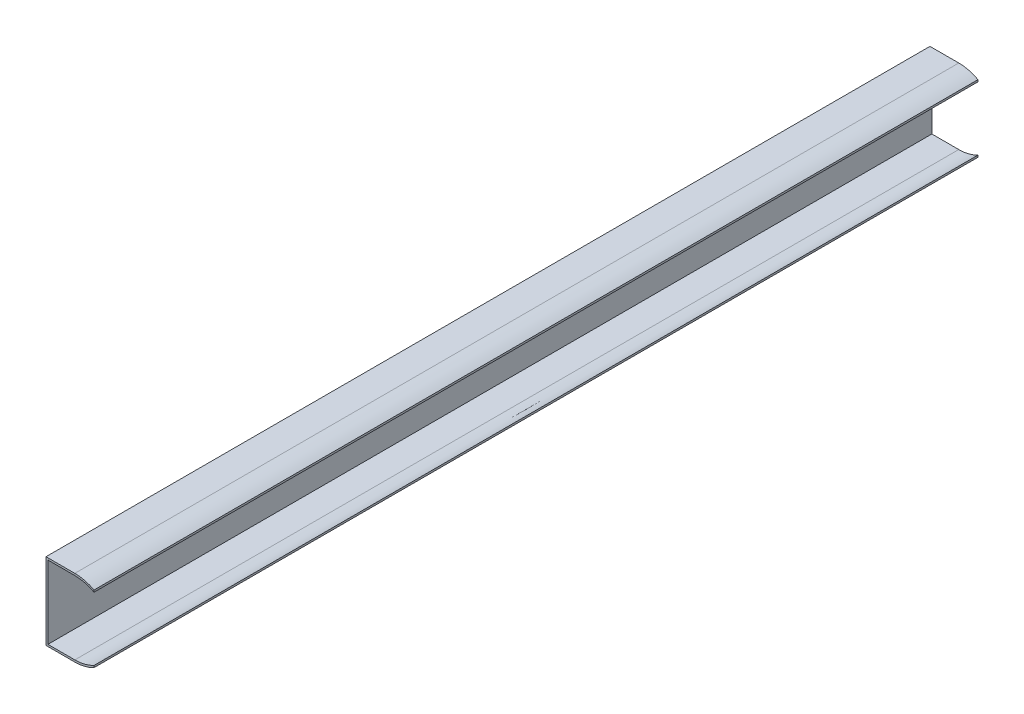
ISO-10303-21;
HEADER;
FILE_DESCRIPTION(('STEP AP214'),'2;1');
FILE_NAME('part.step','',(''),(''),'','','');
FILE_SCHEMA(('AUTOMOTIVE_DESIGN { 1 0 10303 214 1 1 1 1 }'));
ENDSEC;
DATA;
#1=APPLICATION_CONTEXT('core data for automotive mechanical design processes');
#2=APPLICATION_PROTOCOL_DEFINITION('international standard','automotive_design',2000,#1);
#3=PRODUCT_CONTEXT('',#1,'mechanical');
#4=PRODUCT('Part','Part','',(#3));
#5=PRODUCT_RELATED_PRODUCT_CATEGORY('part','',(#4));
#6=PRODUCT_DEFINITION_FORMATION('','',#4);
#7=PRODUCT_DEFINITION_CONTEXT('part definition',#1,'design');
#8=PRODUCT_DEFINITION('design','',#6,#7);
#9=PRODUCT_DEFINITION_SHAPE('','',#8);
#10=(LENGTH_UNIT() NAMED_UNIT(*) SI_UNIT(.MILLI.,.METRE.));
#11=(NAMED_UNIT(*) PLANE_ANGLE_UNIT() SI_UNIT($,.RADIAN.));
#12=(NAMED_UNIT(*) SI_UNIT($,.STERADIAN.) SOLID_ANGLE_UNIT());
#13=UNCERTAINTY_MEASURE_WITH_UNIT(LENGTH_MEASURE(1.E-05),#10,'distance_accuracy_value','');
#14=(GEOMETRIC_REPRESENTATION_CONTEXT(3) GLOBAL_UNCERTAINTY_ASSIGNED_CONTEXT((#13)) GLOBAL_UNIT_ASSIGNED_CONTEXT((#10,
#11,#12)) REPRESENTATION_CONTEXT('',''));
#15=CARTESIAN_POINT('',(0.,0.,0.));
#16=DIRECTION('',(0.,0.,1.));
#17=DIRECTION('',(1.,0.,0.));
#18=AXIS2_PLACEMENT_3D('',#15,#16,#17);
#19=CARTESIAN_POINT('',(0.,0.,920.));
#20=DIRECTION('',(0.,1.,0.));
#21=DIRECTION('',(0.,0.,1.));
#22=AXIS2_PLACEMENT_3D('',#19,#20,#21);
#23=PLANE('',#22);
#24=DIRECTION('',(1.,0.,0.));
#25=VECTOR('',#24,1.);
#26=CARTESIAN_POINT('',(0.,0.,0.));
#27=LINE('',#26,#25);
#28=CARTESIAN_POINT('',(0.,0.,0.));
#29=VERTEX_POINT('',#28);
#30=CARTESIAN_POINT('',(30.,0.,0.));
#31=VERTEX_POINT('',#30);
#32=EDGE_CURVE('E155',#29,#31,#27,.T.);
#33=ORIENTED_EDGE('',*,*,#32,.T.);
#34=DIRECTION('',(0.,0.,-1.));
#35=VECTOR('',#34,1.);
#36=CARTESIAN_POINT('',(30.,0.,920.));
#37=LINE('',#36,#35);
#38=CARTESIAN_POINT('',(30.,0.,920.));
#39=VERTEX_POINT('',#38);
#40=EDGE_CURVE('E11',#39,#31,#37,.T.);
#41=ORIENTED_EDGE('',*,*,#40,.F.);
#42=DIRECTION('',(1.,0.,0.));
#43=VECTOR('',#42,1.);
#44=CARTESIAN_POINT('',(0.,0.,920.));
#45=LINE('',#44,#43);
#46=CARTESIAN_POINT('',(0.,0.,920.));
#47=VERTEX_POINT('',#46);
#48=EDGE_CURVE('E197',#47,#39,#45,.T.);
#49=ORIENTED_EDGE('',*,*,#48,.F.);
#50=DIRECTION('',(0.,0.,-1.));
#51=VECTOR('',#50,1.);
#52=CARTESIAN_POINT('',(0.,0.,920.));
#53=LINE('',#52,#51);
#54=EDGE_CURVE('E148',#47,#29,#53,.T.);
#55=ORIENTED_EDGE('',*,*,#54,.T.);
#56=EDGE_LOOP('',(#33,#41,#49,#55));
#57=FACE_BOUND('',#56,.T.);
#58=ADVANCED_FACE('F32',(#57),#23,.F.);
#59=CARTESIAN_POINT('',(30.,0.,920.));
#60=CARTESIAN_POINT('',(40.6032812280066,0.0484567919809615,920.));
#61=CARTESIAN_POINT('',(50.,5.,920.));
#62=B_SPLINE_CURVE_WITH_KNOTS('',2,(#59,#60,#61),.UNSPECIFIED.,.F.,.F.,(3,3),(0.,1.),.UNSPECIFIED.);
#63=DIRECTION('',(0.,0.,-1.));
#64=VECTOR('',#63,1.);
#65=SURFACE_OF_LINEAR_EXTRUSION('',#62,#64);
#66=CARTESIAN_POINT('',(30.,0.,0.));
#67=CARTESIAN_POINT('',(40.6032812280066,0.0484567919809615,0.));
#68=CARTESIAN_POINT('',(50.,5.,0.));
#69=B_SPLINE_CURVE_WITH_KNOTS('',2,(#66,#67,#68),.UNSPECIFIED.,.F.,.F.,(3,3),(0.,1.),.UNSPECIFIED.);
#70=CARTESIAN_POINT('',(50.,5.,0.));
#71=VERTEX_POINT('',#70);
#72=EDGE_CURVE('E158',#31,#71,#69,.T.);
#73=ORIENTED_EDGE('',*,*,#72,.T.);
#74=DIRECTION('',(0.,0.,-1.));
#75=VECTOR('',#74,1.);
#76=CARTESIAN_POINT('',(50.,5.,920.));
#77=LINE('',#76,#75);
#78=CARTESIAN_POINT('',(50.,5.,920.));
#79=VERTEX_POINT('',#78);
#80=EDGE_CURVE('E40',#79,#71,#77,.T.);
#81=ORIENTED_EDGE('',*,*,#80,.F.);
#82=EDGE_CURVE('E103',#39,#79,#62,.T.);
#83=ORIENTED_EDGE('',*,*,#82,.F.);
#84=ORIENTED_EDGE('',*,*,#40,.T.);
#85=EDGE_LOOP('',(#73,#81,#83,#84));
#86=FACE_BOUND('',#85,.T.);
#87=ADVANCED_FACE('F281',(#86),#65,.F.);
#88=CARTESIAN_POINT('',(50.,5.,920.));
#89=DIRECTION('',(-1.,0.,0.));
#90=DIRECTION('',(0.,0.,1.));
#91=AXIS2_PLACEMENT_3D('',#88,#89,#90);
#92=PLANE('',#91);
#93=DIRECTION('',(0.,1.,0.));
#94=VECTOR('',#93,1.);
#95=CARTESIAN_POINT('',(50.,5.,0.));
#96=LINE('',#95,#94);
#97=CARTESIAN_POINT('',(50.,7.00000000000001,0.));
#98=VERTEX_POINT('',#97);
#99=EDGE_CURVE('E162',#71,#98,#96,.T.);
#100=ORIENTED_EDGE('',*,*,#99,.T.);
#101=DIRECTION('',(0.,0.,-1.));
#102=VECTOR('',#101,1.);
#103=CARTESIAN_POINT('',(50.,7.00000000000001,920.));
#104=LINE('',#103,#102);
#105=CARTESIAN_POINT('',(50.,7.00000000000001,920.));
#106=VERTEX_POINT('',#105);
#107=EDGE_CURVE('E216',#106,#98,#104,.T.);
#108=ORIENTED_EDGE('',*,*,#107,.F.);
#109=DIRECTION('',(0.,1.,0.));
#110=VECTOR('',#109,1.);
#111=CARTESIAN_POINT('',(50.,5.,920.));
#112=LINE('',#111,#110);
#113=EDGE_CURVE('E224',#79,#106,#112,.T.);
#114=ORIENTED_EDGE('',*,*,#113,.F.);
#115=ORIENTED_EDGE('',*,*,#80,.T.);
#116=EDGE_LOOP('',(#100,#108,#114,#115));
#117=FACE_BOUND('',#116,.T.);
#118=ADVANCED_FACE('F222',(#117),#92,.F.);
#119=CARTESIAN_POINT('',(50.,7.00000000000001,920.));
#120=CARTESIAN_POINT('',(40.6032812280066,2.04845679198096,920.));
#121=CARTESIAN_POINT('',(30.,2.,920.));
#122=B_SPLINE_CURVE_WITH_KNOTS('',2,(#119,#120,#121),.UNSPECIFIED.,.F.,.F.,(3,3),(0.,1.),.UNSPECIFIED.);
#123=DIRECTION('',(0.,0.,-1.));
#124=VECTOR('',#123,1.);
#125=SURFACE_OF_LINEAR_EXTRUSION('',#122,#124);
#126=CARTESIAN_POINT('',(50.,7.00000000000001,0.));
#127=CARTESIAN_POINT('',(40.6032812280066,2.04845679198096,0.));
#128=CARTESIAN_POINT('',(30.,2.,0.));
#129=B_SPLINE_CURVE_WITH_KNOTS('',2,(#126,#127,#128),.UNSPECIFIED.,.F.,.F.,(3,3),(0.,1.),.UNSPECIFIED.);
#130=CARTESIAN_POINT('',(30.,2.,0.));
#131=VERTEX_POINT('',#130);
#132=EDGE_CURVE('E167',#98,#131,#129,.T.);
#133=ORIENTED_EDGE('',*,*,#132,.T.);
#134=DIRECTION('',(0.,0.,-1.));
#135=VECTOR('',#134,1.);
#136=CARTESIAN_POINT('',(30.,2.,920.));
#137=LINE('',#136,#135);
#138=CARTESIAN_POINT('',(30.,2.,920.));
#139=VERTEX_POINT('',#138);
#140=EDGE_CURVE('E213',#139,#131,#137,.T.);
#141=ORIENTED_EDGE('',*,*,#140,.F.);
#142=EDGE_CURVE('E242',#106,#139,#122,.T.);
#143=ORIENTED_EDGE('',*,*,#142,.F.);
#144=ORIENTED_EDGE('',*,*,#107,.T.);
#145=EDGE_LOOP('',(#133,#141,#143,#144));
#146=FACE_BOUND('',#145,.T.);
#147=ADVANCED_FACE('F233',(#146),#125,.F.);
#148=CARTESIAN_POINT('',(2.,2.,920.));
#149=DIRECTION('',(0.,-1.,0.));
#150=DIRECTION('',(0.,0.,-1.));
#151=AXIS2_PLACEMENT_3D('',#148,#149,#150);
#152=PLANE('',#151);
#153=DIRECTION('',(-1.,0.,0.));
#154=VECTOR('',#153,1.);
#155=CARTESIAN_POINT('',(2.,2.,0.));
#156=LINE('',#155,#154);
#157=CARTESIAN_POINT('',(2.,2.,0.));
#158=VERTEX_POINT('',#157);
#159=EDGE_CURVE('E171',#131,#158,#156,.T.);
#160=ORIENTED_EDGE('',*,*,#159,.T.);
#161=DIRECTION('',(0.,0.,-1.));
#162=VECTOR('',#161,1.);
#163=CARTESIAN_POINT('',(2.,2.,920.));
#164=LINE('',#163,#162);
#165=CARTESIAN_POINT('',(2.,2.,920.));
#166=VERTEX_POINT('',#165);
#167=EDGE_CURVE('E210',#166,#158,#164,.T.);
#168=ORIENTED_EDGE('',*,*,#167,.F.);
#169=DIRECTION('',(-1.,0.,0.));
#170=VECTOR('',#169,1.);
#171=CARTESIAN_POINT('',(2.,2.,920.));
#172=LINE('',#171,#170);
#173=EDGE_CURVE('E239',#139,#166,#172,.T.);
#174=ORIENTED_EDGE('',*,*,#173,.F.);
#175=ORIENTED_EDGE('',*,*,#140,.T.);
#176=EDGE_LOOP('',(#160,#168,#174,#175));
#177=FACE_BOUND('',#176,.T.);
#178=ADVANCED_FACE('F237',(#177),#152,.F.);
#179=CARTESIAN_POINT('',(2.,78.,920.));
#180=DIRECTION('',(-1.,0.,0.));
#181=DIRECTION('',(0.,0.,1.));
#182=AXIS2_PLACEMENT_3D('',#179,#180,#181);
#183=PLANE('',#182);
#184=DIRECTION('',(0.,1.,0.));
#185=VECTOR('',#184,1.);
#186=CARTESIAN_POINT('',(2.,78.,0.));
#187=LINE('',#186,#185);
#188=CARTESIAN_POINT('',(2.,78.,0.));
#189=VERTEX_POINT('',#188);
#190=EDGE_CURVE('E176',#158,#189,#187,.T.);
#191=ORIENTED_EDGE('',*,*,#190,.T.);
#192=DIRECTION('',(0.,0.,-1.));
#193=VECTOR('',#192,1.);
#194=CARTESIAN_POINT('',(2.,78.,920.));
#195=LINE('',#194,#193);
#196=CARTESIAN_POINT('',(2.,78.,920.));
#197=VERTEX_POINT('',#196);
#198=EDGE_CURVE('E207',#197,#189,#195,.T.);
#199=ORIENTED_EDGE('',*,*,#198,.F.);
#200=DIRECTION('',(0.,1.,0.));
#201=VECTOR('',#200,1.);
#202=CARTESIAN_POINT('',(2.,78.,920.));
#203=LINE('',#202,#201);
#204=EDGE_CURVE('E241',#166,#197,#203,.T.);
#205=ORIENTED_EDGE('',*,*,#204,.F.);
#206=ORIENTED_EDGE('',*,*,#167,.T.);
#207=EDGE_LOOP('',(#191,#199,#205,#206));
#208=FACE_BOUND('',#207,.T.);
#209=ADVANCED_FACE('F271',(#208),#183,.F.);
#210=CARTESIAN_POINT('',(2.,78.,920.));
#211=DIRECTION('',(0.,1.,0.));
#212=DIRECTION('',(0.,0.,1.));
#213=AXIS2_PLACEMENT_3D('',#210,#211,#212);
#214=PLANE('',#213);
#215=DIRECTION('',(1.,0.,0.));
#216=VECTOR('',#215,1.);
#217=CARTESIAN_POINT('',(2.,78.,0.));
#218=LINE('',#217,#216);
#219=CARTESIAN_POINT('',(30.,78.,0.));
#220=VERTEX_POINT('',#219);
#221=EDGE_CURVE('E178',#189,#220,#218,.T.);
#222=ORIENTED_EDGE('',*,*,#221,.T.);
#223=DIRECTION('',(0.,0.,-1.));
#224=VECTOR('',#223,1.);
#225=CARTESIAN_POINT('',(30.,78.,920.));
#226=LINE('',#225,#224);
#227=CARTESIAN_POINT('',(30.,78.,920.));
#228=VERTEX_POINT('',#227);
#229=EDGE_CURVE('E204',#228,#220,#226,.T.);
#230=ORIENTED_EDGE('',*,*,#229,.F.);
#231=DIRECTION('',(1.,0.,0.));
#232=VECTOR('',#231,1.);
#233=CARTESIAN_POINT('',(2.,78.,920.));
#234=LINE('',#233,#232);
#235=EDGE_CURVE('E244',#197,#228,#234,.T.);
#236=ORIENTED_EDGE('',*,*,#235,.F.);
#237=ORIENTED_EDGE('',*,*,#198,.T.);
#238=EDGE_LOOP('',(#222,#230,#236,#237));
#239=FACE_BOUND('',#238,.T.);
#240=ADVANCED_FACE('F266',(#239),#214,.F.);
#241=CARTESIAN_POINT('',(30.,78.,920.));
#242=CARTESIAN_POINT('',(40.6032812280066,77.951543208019,920.));
#243=CARTESIAN_POINT('',(50.,73.,920.));
#244=B_SPLINE_CURVE_WITH_KNOTS('',2,(#241,#242,#243),.UNSPECIFIED.,.F.,.F.,(3,3),(0.,1.),.UNSPECIFIED.);
#245=DIRECTION('',(0.,0.,-1.));
#246=VECTOR('',#245,1.);
#247=SURFACE_OF_LINEAR_EXTRUSION('',#244,#246);
#248=CARTESIAN_POINT('',(30.,78.,0.));
#249=CARTESIAN_POINT('',(40.6032812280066,77.951543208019,0.));
#250=CARTESIAN_POINT('',(50.,73.,0.));
#251=B_SPLINE_CURVE_WITH_KNOTS('',2,(#248,#249,#250),.UNSPECIFIED.,.F.,.F.,(3,3),(0.,1.),.UNSPECIFIED.);
#252=CARTESIAN_POINT('',(50.,73.,0.));
#253=VERTEX_POINT('',#252);
#254=EDGE_CURVE('E180',#220,#253,#251,.T.);
#255=ORIENTED_EDGE('',*,*,#254,.T.);
#256=DIRECTION('',(0.,0.,-1.));
#257=VECTOR('',#256,1.);
#258=CARTESIAN_POINT('',(50.,73.,920.));
#259=LINE('',#258,#257);
#260=CARTESIAN_POINT('',(50.,73.,920.));
#261=VERTEX_POINT('',#260);
#262=EDGE_CURVE('E201',#261,#253,#259,.T.);
#263=ORIENTED_EDGE('',*,*,#262,.F.);
#264=EDGE_CURVE('E253',#228,#261,#244,.T.);
#265=ORIENTED_EDGE('',*,*,#264,.F.);
#266=ORIENTED_EDGE('',*,*,#229,.T.);
#267=EDGE_LOOP('',(#255,#263,#265,#266));
#268=FACE_BOUND('',#267,.T.);
#269=ADVANCED_FACE('F261',(#268),#247,.F.);
#270=CARTESIAN_POINT('',(50.,75.,920.));
#271=DIRECTION('',(-1.,0.,0.));
#272=DIRECTION('',(0.,0.,1.));
#273=AXIS2_PLACEMENT_3D('',#270,#271,#272);
#274=PLANE('',#273);
#275=DIRECTION('',(0.,1.,0.));
#276=VECTOR('',#275,1.);
#277=CARTESIAN_POINT('',(50.,75.,0.));
#278=LINE('',#277,#276);
#279=CARTESIAN_POINT('',(50.,75.,0.));
#280=VERTEX_POINT('',#279);
#281=EDGE_CURVE('E184',#253,#280,#278,.T.);
#282=ORIENTED_EDGE('',*,*,#281,.T.);
#283=DIRECTION('',(0.,0.,-1.));
#284=VECTOR('',#283,1.);
#285=CARTESIAN_POINT('',(50.,75.,920.));
#286=LINE('',#285,#284);
#287=CARTESIAN_POINT('',(50.,75.,920.));
#288=VERTEX_POINT('',#287);
#289=EDGE_CURVE('E143',#288,#280,#286,.T.);
#290=ORIENTED_EDGE('',*,*,#289,.F.);
#291=DIRECTION('',(0.,1.,0.));
#292=VECTOR('',#291,1.);
#293=CARTESIAN_POINT('',(50.,75.,920.));
#294=LINE('',#293,#292);
#295=EDGE_CURVE('E134',#261,#288,#294,.T.);
#296=ORIENTED_EDGE('',*,*,#295,.F.);
#297=ORIENTED_EDGE('',*,*,#262,.T.);
#298=EDGE_LOOP('',(#282,#290,#296,#297));
#299=FACE_BOUND('',#298,.T.);
#300=ADVANCED_FACE('F265',(#299),#274,.F.);
#301=CARTESIAN_POINT('',(50.,75.,920.));
#302=CARTESIAN_POINT('',(40.6032812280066,79.951543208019,920.));
#303=CARTESIAN_POINT('',(30.,80.,920.));
#304=B_SPLINE_CURVE_WITH_KNOTS('',2,(#301,#302,#303),.UNSPECIFIED.,.F.,.F.,(3,3),(0.,1.),.UNSPECIFIED.);
#305=DIRECTION('',(0.,0.,-1.));
#306=VECTOR('',#305,1.);
#307=SURFACE_OF_LINEAR_EXTRUSION('',#304,#306);
#308=CARTESIAN_POINT('',(50.,75.,0.));
#309=CARTESIAN_POINT('',(40.6032812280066,79.951543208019,0.));
#310=CARTESIAN_POINT('',(30.,80.,0.));
#311=B_SPLINE_CURVE_WITH_KNOTS('',2,(#308,#309,#310),.UNSPECIFIED.,.F.,.F.,(3,3),(0.,1.),.UNSPECIFIED.);
#312=CARTESIAN_POINT('',(30.,80.,0.));
#313=VERTEX_POINT('',#312);
#314=EDGE_CURVE('E142',#280,#313,#311,.T.);
#315=ORIENTED_EDGE('',*,*,#314,.T.);
#316=DIRECTION('',(0.,0.,-1.));
#317=VECTOR('',#316,1.);
#318=CARTESIAN_POINT('',(30.,80.,920.));
#319=LINE('',#318,#317);
#320=CARTESIAN_POINT('',(30.,80.,920.));
#321=VERTEX_POINT('',#320);
#322=EDGE_CURVE('E139',#321,#313,#319,.T.);
#323=ORIENTED_EDGE('',*,*,#322,.F.);
#324=EDGE_CURVE('E128',#288,#321,#304,.T.);
#325=ORIENTED_EDGE('',*,*,#324,.F.);
#326=ORIENTED_EDGE('',*,*,#289,.T.);
#327=EDGE_LOOP('',(#315,#323,#325,#326));
#328=FACE_BOUND('',#327,.T.);
#329=ADVANCED_FACE('F140',(#328),#307,.F.);
#330=CARTESIAN_POINT('',(0.,80.,920.));
#331=DIRECTION('',(0.,-1.,0.));
#332=DIRECTION('',(0.,0.,-1.));
#333=AXIS2_PLACEMENT_3D('',#330,#331,#332);
#334=PLANE('',#333);
#335=DIRECTION('',(-1.,0.,0.));
#336=VECTOR('',#335,1.);
#337=CARTESIAN_POINT('',(0.,80.,0.));
#338=LINE('',#337,#336);
#339=CARTESIAN_POINT('',(0.,80.,0.));
#340=VERTEX_POINT('',#339);
#341=EDGE_CURVE('E89',#313,#340,#338,.T.);
#342=ORIENTED_EDGE('',*,*,#341,.T.);
#343=DIRECTION('',(0.,0.,-1.));
#344=VECTOR('',#343,1.);
#345=CARTESIAN_POINT('',(0.,80.,920.));
#346=LINE('',#345,#344);
#347=CARTESIAN_POINT('',(0.,80.,920.));
#348=VERTEX_POINT('',#347);
#349=EDGE_CURVE('E144',#348,#340,#346,.T.);
#350=ORIENTED_EDGE('',*,*,#349,.F.);
#351=DIRECTION('',(-1.,0.,0.));
#352=VECTOR('',#351,1.);
#353=CARTESIAN_POINT('',(0.,80.,920.));
#354=LINE('',#353,#352);
#355=EDGE_CURVE('E132',#321,#348,#354,.T.);
#356=ORIENTED_EDGE('',*,*,#355,.F.);
#357=ORIENTED_EDGE('',*,*,#322,.T.);
#358=EDGE_LOOP('',(#342,#350,#356,#357));
#359=FACE_BOUND('',#358,.T.);
#360=ADVANCED_FACE('F146',(#359),#334,.F.);
#361=CARTESIAN_POINT('',(0.,0.,920.));
#362=DIRECTION('',(1.,0.,0.));
#363=DIRECTION('',(0.,0.,-1.));
#364=AXIS2_PLACEMENT_3D('',#361,#362,#363);
#365=PLANE('',#364);
#366=DIRECTION('',(0.,-1.,0.));
#367=VECTOR('',#366,1.);
#368=CARTESIAN_POINT('',(0.,0.,0.));
#369=LINE('',#368,#367);
#370=EDGE_CURVE('E95',#340,#29,#369,.T.);
#371=ORIENTED_EDGE('',*,*,#370,.T.);
#372=ORIENTED_EDGE('',*,*,#54,.F.);
#373=DIRECTION('',(0.,-1.,0.));
#374=VECTOR('',#373,1.);
#375=CARTESIAN_POINT('',(0.,0.,920.));
#376=LINE('',#375,#374);
#377=EDGE_CURVE('E48',#348,#47,#376,.T.);
#378=ORIENTED_EDGE('',*,*,#377,.F.);
#379=ORIENTED_EDGE('',*,*,#349,.T.);
#380=EDGE_LOOP('',(#371,#372,#378,#379));
#381=FACE_BOUND('',#380,.T.);
#382=ADVANCED_FACE('F357',(#381),#365,.F.);
#383=CARTESIAN_POINT('',(40.3016406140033,1.27422839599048,920.));
#384=DIRECTION('',(0.,0.,-1.));
#385=DIRECTION('',(-1.,0.,0.));
#386=AXIS2_PLACEMENT_3D('',#383,#384,#385);
#387=PLANE('',#386);
#388=ORIENTED_EDGE('',*,*,#48,.T.);
#389=ORIENTED_EDGE('',*,*,#82,.T.);
#390=ORIENTED_EDGE('',*,*,#113,.T.);
#391=ORIENTED_EDGE('',*,*,#142,.T.);
#392=ORIENTED_EDGE('',*,*,#173,.T.);
#393=ORIENTED_EDGE('',*,*,#204,.T.);
#394=ORIENTED_EDGE('',*,*,#235,.T.);
#395=ORIENTED_EDGE('',*,*,#264,.T.);
#396=ORIENTED_EDGE('',*,*,#295,.T.);
#397=ORIENTED_EDGE('',*,*,#324,.T.);
#398=ORIENTED_EDGE('',*,*,#355,.T.);
#399=ORIENTED_EDGE('',*,*,#377,.T.);
#400=EDGE_LOOP('',(#388,#389,#390,#391,#392,#393,#394,#395,#396,#397,#398,#399));
#401=FACE_BOUND('',#400,.T.);
#402=ADVANCED_FACE('F130',(#401),#387,.F.);
#403=CARTESIAN_POINT('',(40.3016406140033,1.27422839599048,0.));
#404=DIRECTION('',(0.,0.,-1.));
#405=DIRECTION('',(-1.,0.,0.));
#406=AXIS2_PLACEMENT_3D('',#403,#404,#405);
#407=PLANE('',#406);
#408=ORIENTED_EDGE('',*,*,#32,.F.);
#409=ORIENTED_EDGE('',*,*,#370,.F.);
#410=ORIENTED_EDGE('',*,*,#341,.F.);
#411=ORIENTED_EDGE('',*,*,#314,.F.);
#412=ORIENTED_EDGE('',*,*,#281,.F.);
#413=ORIENTED_EDGE('',*,*,#254,.F.);
#414=ORIENTED_EDGE('',*,*,#221,.F.);
#415=ORIENTED_EDGE('',*,*,#190,.F.);
#416=ORIENTED_EDGE('',*,*,#159,.F.);
#417=ORIENTED_EDGE('',*,*,#132,.F.);
#418=ORIENTED_EDGE('',*,*,#99,.F.);
#419=ORIENTED_EDGE('',*,*,#72,.F.);
#420=EDGE_LOOP('',(#408,#409,#410,#411,#412,#413,#414,#415,#416,#417,#418,#419));
#421=FACE_BOUND('',#420,.T.);
#422=ADVANCED_FACE('F228',(#421),#407,.T.);
#423=CLOSED_SHELL('',(#58,#87,#118,#147,#178,#209,#240,#269,#300,#329,#360,#382,#402,#422));
#424=MANIFOLD_SOLID_BREP('B2',#423);
#425=ADVANCED_BREP_SHAPE_REPRESENTATION('',(#18,#424),#14);
#426=SHAPE_DEFINITION_REPRESENTATION(#9,#425);
ENDSEC;
END-ISO-10303-21;
